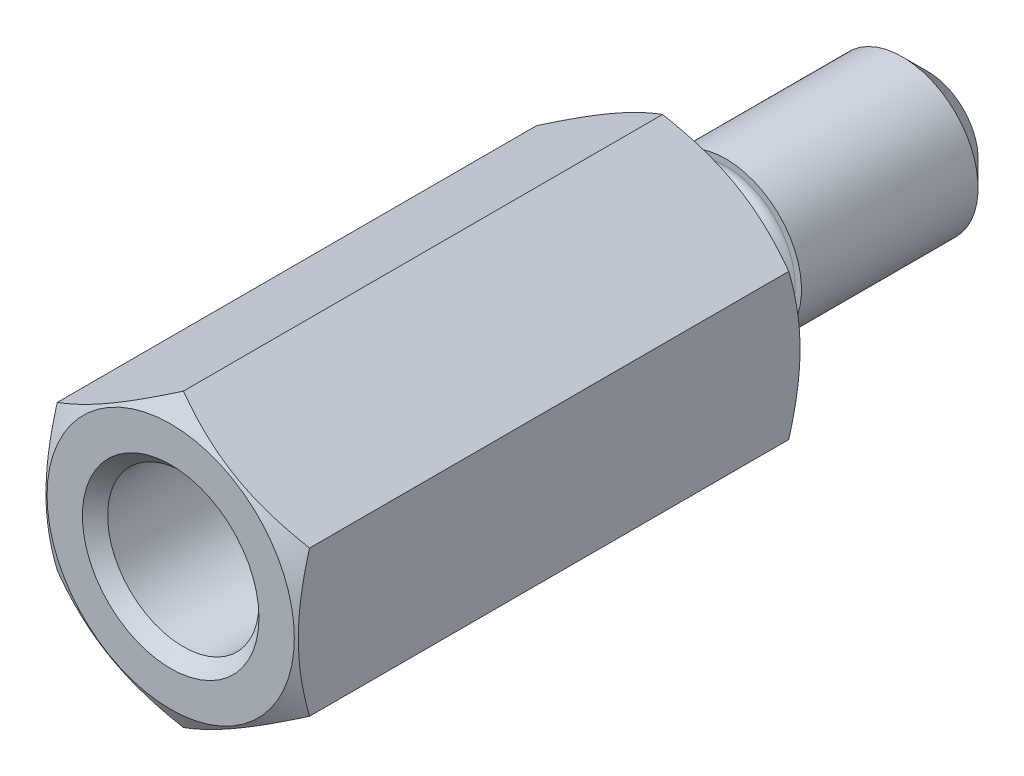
ISO-10303-21;
HEADER;
FILE_DESCRIPTION(('STEP AP214'),'2;1');
FILE_NAME('part.step','',(''),(''),'','','');
FILE_SCHEMA(('AUTOMOTIVE_DESIGN { 1 0 10303 214 1 1 1 1 }'));
ENDSEC;
DATA;
#1=APPLICATION_CONTEXT('core data for automotive mechanical design processes');
#2=APPLICATION_PROTOCOL_DEFINITION('international standard','automotive_design',2000,#1);
#3=PRODUCT_CONTEXT('',#1,'mechanical');
#4=PRODUCT('Part','Part','',(#3));
#5=PRODUCT_RELATED_PRODUCT_CATEGORY('part','',(#4));
#6=PRODUCT_DEFINITION_FORMATION('','',#4);
#7=PRODUCT_DEFINITION_CONTEXT('part definition',#1,'design');
#8=PRODUCT_DEFINITION('design','',#6,#7);
#9=PRODUCT_DEFINITION_SHAPE('','',#8);
#10=(LENGTH_UNIT() NAMED_UNIT(*) SI_UNIT(.MILLI.,.METRE.));
#11=(NAMED_UNIT(*) PLANE_ANGLE_UNIT() SI_UNIT($,.RADIAN.));
#12=(NAMED_UNIT(*) SI_UNIT($,.STERADIAN.) SOLID_ANGLE_UNIT());
#13=UNCERTAINTY_MEASURE_WITH_UNIT(LENGTH_MEASURE(1.E-05),#10,'distance_accuracy_value','');
#14=(GEOMETRIC_REPRESENTATION_CONTEXT(3) GLOBAL_UNCERTAINTY_ASSIGNED_CONTEXT((#13)) GLOBAL_UNIT_ASSIGNED_CONTEXT((#10,
#11,#12)) REPRESENTATION_CONTEXT('',''));
#15=CARTESIAN_POINT('',(0.,0.,0.));
#16=DIRECTION('',(0.,0.,1.));
#17=DIRECTION('',(1.,0.,0.));
#18=AXIS2_PLACEMENT_3D('',#15,#16,#17);
#19=CARTESIAN_POINT('',(0.,-5.77350269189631,0.));
#20=DIRECTION('',(0.,0.,-1.));
#21=DIRECTION('',(-1.,0.,0.));
#22=AXIS2_PLACEMENT_3D('',#19,#20,#21);
#23=PLANE('',#22);
#24=CARTESIAN_POINT('',(0.,0.,0.));
#25=DIRECTION('',(0.,0.,-1.));
#26=DIRECTION('',(-1.,0.,0.));
#27=AXIS2_PLACEMENT_3D('',#24,#25,#26);
#28=CIRCLE('',#27,2.75);
#29=CARTESIAN_POINT('',(-2.75,0.,0.));
#30=VERTEX_POINT('',#29);
#31=EDGE_CURVE('E23',#30,#30,#28,.F.);
#32=ORIENTED_EDGE('',*,*,#31,.T.);
#33=EDGE_LOOP('',(#32));
#34=FACE_BOUND('',#33,.T.);
#35=CARTESIAN_POINT('',(0.,0.,0.));
#36=DIRECTION('',(0.,0.,-1.));
#37=DIRECTION('',(-1.,0.,0.));
#38=AXIS2_PLACEMENT_3D('',#35,#36,#37);
#39=CIRCLE('',#38,4.9);
#40=CARTESIAN_POINT('',(-4.9,0.,0.));
#41=VERTEX_POINT('',#40);
#42=EDGE_CURVE('E73',#41,#41,#39,.T.);
#43=ORIENTED_EDGE('',*,*,#42,.T.);
#44=EDGE_LOOP('',(#43));
#45=FACE_BOUND('',#44,.T.);
#46=ADVANCED_FACE('F14',(#34,#45),#23,.T.);
#47=CARTESIAN_POINT('',(0.,0.,-10.));
#48=DIRECTION('',(0.,0.,1.));
#49=DIRECTION('',(1.,0.,0.));
#50=AXIS2_PLACEMENT_3D('',#47,#48,#49);
#51=CYLINDRICAL_SURFACE('',#50,3.);
#52=CARTESIAN_POINT('',(0.,0.,-2.));
#53=DIRECTION('',(0.,0.,-1.));
#54=DIRECTION('',(-1.,0.,0.));
#55=AXIS2_PLACEMENT_3D('',#52,#53,#54);
#56=CIRCLE('',#55,3.);
#57=CARTESIAN_POINT('',(-3.,0.,-2.));
#58=VERTEX_POINT('',#57);
#59=EDGE_CURVE('E233',#58,#58,#56,.T.);
#60=ORIENTED_EDGE('',*,*,#59,.T.);
#61=EDGE_LOOP('',(#60));
#62=FACE_BOUND('',#61,.T.);
#63=CARTESIAN_POINT('',(0.,0.,-9.));
#64=DIRECTION('',(0.,0.,-1.));
#65=DIRECTION('',(-1.,0.,0.));
#66=AXIS2_PLACEMENT_3D('',#63,#64,#65);
#67=CIRCLE('',#66,3.);
#68=CARTESIAN_POINT('',(-3.,0.,-9.));
#69=VERTEX_POINT('',#68);
#70=EDGE_CURVE('E85',#69,#69,#67,.F.);
#71=ORIENTED_EDGE('',*,*,#70,.T.);
#72=EDGE_LOOP('',(#71));
#73=FACE_BOUND('',#72,.T.);
#74=ADVANCED_FACE('F209',(#62,#73),#51,.T.);
#75=CARTESIAN_POINT('',(0.,0.,-10.));
#76=DIRECTION('',(0.,0.,-1.));
#77=DIRECTION('',(-1.,0.,0.));
#78=AXIS2_PLACEMENT_3D('',#75,#76,#77);
#79=PLANE('',#78);
#80=CARTESIAN_POINT('',(0.,0.,-10.));
#81=DIRECTION('',(0.,0.,-1.));
#82=DIRECTION('',(-1.,0.,0.));
#83=AXIS2_PLACEMENT_3D('',#80,#81,#82);
#84=CIRCLE('',#83,2.);
#85=CARTESIAN_POINT('',(-2.,0.,-10.));
#86=VERTEX_POINT('',#85);
#87=EDGE_CURVE('E82',#86,#86,#84,.T.);
#88=ORIENTED_EDGE('',*,*,#87,.T.);
#89=EDGE_LOOP('',(#88));
#90=FACE_BOUND('',#89,.T.);
#91=ADVANCED_FACE('F213',(#90),#79,.T.);
#92=CARTESIAN_POINT('',(0.,0.,-10.));
#93=DIRECTION('',(0.,0.,1.));
#94=DIRECTION('',(1.,0.,0.));
#95=AXIS2_PLACEMENT_3D('',#92,#93,#94);
#96=CONICAL_SURFACE('',#95,2.,0.785398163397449);
#97=ORIENTED_EDGE('',*,*,#70,.F.);
#98=EDGE_LOOP('',(#97));
#99=FACE_BOUND('',#98,.T.);
#100=ORIENTED_EDGE('',*,*,#87,.F.);
#101=EDGE_LOOP('',(#100));
#102=FACE_BOUND('',#101,.T.);
#103=ADVANCED_FACE('F216',(#99,#102),#96,.T.);
#104=CARTESIAN_POINT('',(0.,0.,-2.));
#105=DIRECTION('',(0.,0.,-1.));
#106=DIRECTION('',(-1.,0.,0.));
#107=AXIS2_PLACEMENT_3D('',#104,#105,#106);
#108=PLANE('',#107);
#109=CARTESIAN_POINT('',(0.,0.,-2.));
#110=DIRECTION('',(0.,0.,-1.));
#111=DIRECTION('',(-1.,0.,0.));
#112=AXIS2_PLACEMENT_3D('',#109,#110,#111);
#113=CIRCLE('',#112,2.75);
#114=CARTESIAN_POINT('',(-2.75,0.,-2.));
#115=VERTEX_POINT('',#114);
#116=EDGE_CURVE('E93',#115,#115,#113,.T.);
#117=ORIENTED_EDGE('',*,*,#116,.T.);
#118=EDGE_LOOP('',(#117));
#119=FACE_BOUND('',#118,.T.);
#120=ORIENTED_EDGE('',*,*,#59,.F.);
#121=EDGE_LOOP('',(#120));
#122=FACE_BOUND('',#121,.T.);
#123=ADVANCED_FACE('F218',(#119,#122),#108,.F.);
#124=CARTESIAN_POINT('',(0.,0.,-2.));
#125=DIRECTION('',(0.,0.,1.));
#126=DIRECTION('',(1.,0.,0.));
#127=AXIS2_PLACEMENT_3D('',#124,#125,#126);
#128=CYLINDRICAL_SURFACE('',#127,2.35);
#129=CARTESIAN_POINT('',(0.,0.,-1.6));
#130=DIRECTION('',(0.,0.,-1.));
#131=DIRECTION('',(-1.,0.,0.));
#132=AXIS2_PLACEMENT_3D('',#129,#130,#131);
#133=CIRCLE('',#132,2.35);
#134=CARTESIAN_POINT('',(-2.35,0.,-1.6));
#135=VERTEX_POINT('',#134);
#136=EDGE_CURVE('E99',#135,#135,#133,.F.);
#137=ORIENTED_EDGE('',*,*,#136,.T.);
#138=EDGE_LOOP('',(#137));
#139=FACE_BOUND('',#138,.T.);
#140=CARTESIAN_POINT('',(0.,0.,-0.4));
#141=DIRECTION('',(0.,0.,-1.));
#142=DIRECTION('',(-1.,0.,0.));
#143=AXIS2_PLACEMENT_3D('',#140,#141,#142);
#144=CIRCLE('',#143,2.35);
#145=CARTESIAN_POINT('',(-2.35,0.,-0.4));
#146=VERTEX_POINT('',#145);
#147=EDGE_CURVE('E96',#146,#146,#144,.T.);
#148=ORIENTED_EDGE('',*,*,#147,.T.);
#149=EDGE_LOOP('',(#148));
#150=FACE_BOUND('',#149,.T.);
#151=ADVANCED_FACE('F121',(#139,#150),#128,.T.);
#152=CARTESIAN_POINT('',(0.,0.,-1.6));
#153=DIRECTION('',(0.,0.,-1.));
#154=DIRECTION('',(-1.,0.,0.));
#155=AXIS2_PLACEMENT_3D('',#152,#153,#154);
#156=TOROIDAL_SURFACE('',#155,2.75,0.4);
#157=ORIENTED_EDGE('',*,*,#136,.F.);
#158=EDGE_LOOP('',(#157));
#159=FACE_BOUND('',#158,.T.);
#160=ORIENTED_EDGE('',*,*,#116,.F.);
#161=EDGE_LOOP('',(#160));
#162=FACE_BOUND('',#161,.T.);
#163=ADVANCED_FACE('F226',(#159,#162),#156,.F.);
#164=CARTESIAN_POINT('',(0.,0.,-0.4));
#165=DIRECTION('',(0.,0.,-1.));
#166=DIRECTION('',(-1.,0.,0.));
#167=AXIS2_PLACEMENT_3D('',#164,#165,#166);
#168=TOROIDAL_SURFACE('',#167,2.75,0.4);
#169=ORIENTED_EDGE('',*,*,#31,.F.);
#170=EDGE_LOOP('',(#169));
#171=FACE_BOUND('',#170,.T.);
#172=ORIENTED_EDGE('',*,*,#147,.F.);
#173=EDGE_LOOP('',(#172));
#174=FACE_BOUND('',#173,.T.);
#175=ADVANCED_FACE('F16',(#171,#174),#168,.F.);
#176=CARTESIAN_POINT('',(0.,0.,0.));
#177=DIRECTION('',(0.,0.,1.));
#178=DIRECTION('',(-1.,0.,0.));
#179=AXIS2_PLACEMENT_3D('',#176,#177,#178);
#180=CONICAL_SURFACE('',#179,4.9,1.0471975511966);
#181=ORIENTED_EDGE('',*,*,#42,.F.);
#182=EDGE_LOOP('',(#181));
#183=FACE_BOUND('',#182,.T.);
#184=CARTESIAN_POINT('',(5.,-28.5513155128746,13.9059532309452));
#185=CARTESIAN_POINT('',(4.99999999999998,-27.6630523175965,13.4008421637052));
#186=CARTESIAN_POINT('',(4.99999999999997,-26.7745196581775,12.8962030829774));
#187=CARTESIAN_POINT('',(4.99999999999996,-24.9956560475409,11.8877916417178));
#188=CARTESIAN_POINT('',(4.99999999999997,-24.1053241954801,11.3840208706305));
#189=CARTESIAN_POINT('',(4.99999999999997,-22.3038221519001,10.3672445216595));
#190=CARTESIAN_POINT('',(4.99999999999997,-21.3926277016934,9.85428190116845));
#191=CARTESIAN_POINT('',(4.99999999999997,-19.5696429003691,8.83179914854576));
#192=CARTESIAN_POINT('',(4.99999999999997,-18.657854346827,8.32227581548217));
#193=CARTESIAN_POINT('',(4.99999999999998,-17.1140952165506,7.46439841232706));
#194=CARTESIAN_POINT('',(4.99999999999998,-16.4827544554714,7.11491185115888));
#195=CARTESIAN_POINT('',(4.99999999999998,-15.2184982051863,6.4188021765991));
#196=CARTESIAN_POINT('',(4.99999999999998,-14.5855827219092,6.07217905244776));
#197=CARTESIAN_POINT('',(4.99999999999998,-13.3150329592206,5.3816200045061));
#198=CARTESIAN_POINT('',(4.99999999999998,-12.6773899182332,5.03770015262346));
#199=CARTESIAN_POINT('',(4.99999999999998,-11.7185820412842,4.52648798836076));
#200=CARTESIAN_POINT('',(4.99999999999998,-11.3986460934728,4.35689168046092));
#201=CARTESIAN_POINT('',(4.99999999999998,-10.7577581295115,4.01963122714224));
#202=CARTESIAN_POINT('',(4.99999999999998,-10.4368061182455,3.85196707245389));
#203=CARTESIAN_POINT('',(4.99999999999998,-9.79912424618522,3.52192099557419));
#204=CARTESIAN_POINT('',(4.99999999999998,-9.48241579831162,3.35949775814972));
#205=CARTESIAN_POINT('',(4.99999999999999,-8.84745364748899,3.03767752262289));
#206=CARTESIAN_POINT('',(4.99999999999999,-8.52919991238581,2.87828058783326));
#207=CARTESIAN_POINT('',(4.99999999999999,-7.89025618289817,2.56321436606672));
#208=CARTESIAN_POINT('',(4.99999999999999,-7.56956325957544,2.40755100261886));
#209=CARTESIAN_POINT('',(4.99999999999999,-6.92566102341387,2.10154520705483));
#210=CARTESIAN_POINT('',(4.99999999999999,-6.60245186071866,1.95120246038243));
#211=CARTESIAN_POINT('',(4.99999999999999,-5.95511193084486,1.65885364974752));
#212=CARTESIAN_POINT('',(4.99999999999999,-5.63100520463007,1.51679464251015));
#213=CARTESIAN_POINT('',(4.99999999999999,-4.97844812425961,1.24262482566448));
#214=CARTESIAN_POINT('',(4.99999999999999,-4.64999647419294,1.11051706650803));
#215=CARTESIAN_POINT('',(4.99999999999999,-3.98854124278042,0.860874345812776));
#216=CARTESIAN_POINT('',(4.99999999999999,-3.65555200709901,0.743301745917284));
#217=CARTESIAN_POINT('',(5.,-2.98310602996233,0.528595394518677));
#218=CARTESIAN_POINT('',(5.00000000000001,-2.6436549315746,0.431444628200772));
#219=CARTESIAN_POINT('',(5.,-2.23946183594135,0.333898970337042));
#220=CARTESIAN_POINT('',(4.99999999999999,-2.17803640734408,0.319561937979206));
#221=CARTESIAN_POINT('',(4.99999999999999,-2.05495871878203,0.291861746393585));
#222=CARTESIAN_POINT('',(4.99999999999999,-1.99330643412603,0.278498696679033));
#223=CARTESIAN_POINT('',(4.99999999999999,-1.80799287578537,0.239944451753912));
#224=CARTESIAN_POINT('',(4.99999999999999,-1.68400579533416,0.216295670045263));
#225=CARTESIAN_POINT('',(4.99999999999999,-1.43531101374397,0.173540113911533));
#226=CARTESIAN_POINT('',(4.99999999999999,-1.31060369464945,0.15443112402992));
#227=CARTESIAN_POINT('',(4.99999999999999,-1.06053603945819,0.1211215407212));
#228=CARTESIAN_POINT('',(5.,-0.93517573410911,0.106920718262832));
#229=CARTESIAN_POINT('',(5.,-0.6867240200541,0.0839938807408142));
#230=CARTESIAN_POINT('',(5.,-0.563643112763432,0.075154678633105));
#231=CARTESIAN_POINT('',(5.,-0.317218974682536,0.0626709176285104));
#232=CARTESIAN_POINT('',(5.,-0.193875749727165,0.0590262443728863));
#233=CARTESIAN_POINT('',(5.,0.0529223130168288,0.0570173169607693));
#234=CARTESIAN_POINT('',(5.,0.176377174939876,0.0586559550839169));
#235=CARTESIAN_POINT('',(5.,0.423107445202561,0.0671792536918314));
#236=CARTESIAN_POINT('',(5.,0.546382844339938,0.074064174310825));
#237=CARTESIAN_POINT('',(5.,0.840374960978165,0.0965927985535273));
#238=CARTESIAN_POINT('',(5.,1.01091463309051,0.114600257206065));
#239=CARTESIAN_POINT('',(5.,1.35077920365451,0.159696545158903));
#240=CARTESIAN_POINT('',(5.,1.52010394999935,0.186786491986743));
#241=CARTESIAN_POINT('',(5.,2.02590980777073,0.280230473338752));
#242=CARTESIAN_POINT('',(5.,2.36017513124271,0.358754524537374));
#243=CARTESIAN_POINT('',(5.,2.86099113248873,0.495780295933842));
#244=CARTESIAN_POINT('',(5.,3.03010177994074,0.54546679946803));
#245=CARTESIAN_POINT('',(5.,3.36667786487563,0.650180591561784));
#246=CARTESIAN_POINT('',(5.,3.53414328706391,0.70520792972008));
#247=CARTESIAN_POINT('',(5.,3.86751086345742,0.819713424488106));
#248=CARTESIAN_POINT('',(5.,4.03341318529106,0.879191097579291));
#249=CARTESIAN_POINT('',(5.,4.36382473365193,1.00186561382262));
#250=CARTESIAN_POINT('',(5.,4.52833402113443,1.06506229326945));
#251=CARTESIAN_POINT('',(5.,4.88531375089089,1.20609806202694));
#252=CARTESIAN_POINT('',(5.,5.0775453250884,1.2845402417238));
#253=CARTESIAN_POINT('',(5.,5.46053865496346,1.44494192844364));
#254=CARTESIAN_POINT('',(5.,5.65130034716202,1.52690158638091));
#255=CARTESIAN_POINT('',(5.,6.22176568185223,1.77709837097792));
#256=CARTESIAN_POINT('',(5.,6.59958569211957,1.94962754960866));
#257=CARTESIAN_POINT('',(5.00000000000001,7.35178984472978,2.30261864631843));
#258=CARTESIAN_POINT('',(5.00000000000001,7.7261713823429,2.48308606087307));
#259=CARTESIAN_POINT('',(5.00000000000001,8.47215735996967,2.84957212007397));
#260=CARTESIAN_POINT('',(5.00000000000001,8.84376205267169,3.03559025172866));
#261=CARTESIAN_POINT('',(5.00000000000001,9.58576462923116,3.412125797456));
#262=CARTESIAN_POINT('',(5.00000000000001,9.95615770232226,3.60265266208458));
#263=CARTESIAN_POINT('',(5.00000000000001,10.6953591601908,3.98676915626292));
#264=CARTESIAN_POINT('',(5.00000000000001,11.0641675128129,4.18035884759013));
#265=CARTESIAN_POINT('',(5.00000000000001,11.8003936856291,4.56980246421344));
#266=CARTESIAN_POINT('',(5.00000000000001,12.1678120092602,4.76565543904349));
#267=CARTESIAN_POINT('',(5.00000000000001,12.9016659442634,5.15919489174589));
#268=CARTESIAN_POINT('',(5.00000000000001,13.2681015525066,5.3568813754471));
#269=CARTESIAN_POINT('',(5.00000000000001,14.2559293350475,5.89232643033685));
#270=CARTESIAN_POINT('',(5.00000000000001,14.8765808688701,6.23145087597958));
#271=CARTESIAN_POINT('',(5.00000000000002,16.1163495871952,6.91265943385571));
#272=CARTESIAN_POINT('',(5.00000000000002,16.7354665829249,7.25474388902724));
#273=CARTESIAN_POINT('',(5.00000000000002,17.9698926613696,7.93957714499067));
#274=CARTESIAN_POINT('',(5.00000000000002,18.5852067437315,8.28231694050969));
#275=CARTESIAN_POINT('',(5.00000000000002,19.8148562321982,8.96936332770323));
#276=CARTESIAN_POINT('',(5.00000000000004,20.4291917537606,9.31366971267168));
#277=CARTESIAN_POINT('',(5.00000000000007,21.0432119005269,9.6585343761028));
#278=B_SPLINE_CURVE_WITH_KNOTS('',3,(#184,#185,#186,#187,#188,#189,#190,#191,#192,#193,#194,
#195,#196,#197,#198,#199,#200,#201,#202,#203,#204,#205,#206,#207,#208,#209,#210,#211,#212,#213,
#214,#215,#216,#217,#218,#219,#220,#221,#222,#223,#224,#225,#226,#227,#228,#229,#230,#231,#232,
#233,#234,#235,#236,#237,#238,#239,#240,#241,#242,#243,#244,#245,#246,#247,#248,#249,#250,#251,
#252,#253,#254,#255,#256,#257,#258,#259,#260,#261,#262,#263,#264,#265,#266,#267,#268,#269,#270,
#271,#272,#273,#274,#275,#276,#277),.UNSPECIFIED.,.F.,.F.,(4,2,2,2,2,2,2,2,2,2,2,2,2,2,2,2,2,2,
2,2,2,2,2,2,2,2,2,2,2,2,2,2,2,2,2,2,2,2,2,2,2,2,2,2,2,2,4),(0.,3.06550911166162,
6.13442960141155,9.27140801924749,12.4048883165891,14.5697357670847,16.7345750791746,
18.9079851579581,19.9943030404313,21.0806157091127,22.1483907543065,23.2161881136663,
24.2855804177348,25.3549093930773,26.4164153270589,27.4782453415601,28.5372654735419,
29.5953997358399,29.7846231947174,29.9738678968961,30.3524526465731,30.7308522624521,
31.1092342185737,31.47932184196,31.8494013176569,32.2196834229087,32.5899838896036,
33.1041595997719,33.6183985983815,34.6470187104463,35.1757476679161,35.7044815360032,
36.2331580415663,36.7618112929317,37.3846276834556,38.0074708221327,39.2533636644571,
40.5001331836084,41.7467878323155,42.9963393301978,44.2459160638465,45.4949858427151,
46.7440595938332,48.8658205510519,50.9878307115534,53.1008206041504,55.213539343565),.UNSPECIFIED.);
#279=CARTESIAN_POINT('',(5.,2.88675134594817,0.504317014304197));
#280=VERTEX_POINT('',#279);
#281=CARTESIAN_POINT('',(5.,-2.88675134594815,0.504317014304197));
#282=VERTEX_POINT('',#281);
#283=EDGE_CURVE('E30',#280,#282,#278,.F.);
#284=ORIENTED_EDGE('',*,*,#283,.T.);
#285=CARTESIAN_POINT('',(5.0002,-2.88663587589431,0.504383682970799));
#286=CARTESIAN_POINT('',(4.78046540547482,-3.0134997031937,0.431121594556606));
#287=CARTESIAN_POINT('',(4.55885141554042,-3.14144859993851,0.364486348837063));
#288=CARTESIAN_POINT('',(4.11178600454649,-3.39956193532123,0.248174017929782));
#289=CARTESIAN_POINT('',(3.88632664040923,-3.5297309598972,0.19853807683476));
#290=CARTESIAN_POINT('',(3.4381676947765,-3.78847564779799,0.121286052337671));
#291=CARTESIAN_POINT('',(3.21553790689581,-3.91701101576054,0.0931554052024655));
#292=CARTESIAN_POINT('',(2.88081009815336,-4.11026620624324,0.067929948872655));
#293=CARTESIAN_POINT('',(2.76915780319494,-4.17472868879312,0.062348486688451));
#294=CARTESIAN_POINT('',(2.54575002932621,-4.3037132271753,0.056937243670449));
#295=CARTESIAN_POINT('',(2.4339945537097,-4.36823528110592,0.0571072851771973));
#296=CARTESIAN_POINT('',(2.12781576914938,-4.54500768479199,0.0654886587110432));
#297=CARTESIAN_POINT('',(1.93349391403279,-4.65719946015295,0.0795647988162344));
#298=CARTESIAN_POINT('',(1.54613989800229,-4.88083840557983,0.124200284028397));
#299=CARTESIAN_POINT('',(1.35310909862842,-4.99228478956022,0.154774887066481));
#300=CARTESIAN_POINT('',(0.964974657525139,-5.21637431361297,0.231203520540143));
#301=CARTESIAN_POINT('',(0.769920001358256,-5.32898917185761,0.277381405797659));
#302=CARTESIAN_POINT('',(0.382719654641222,-5.55253939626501,0.38218682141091));
#303=CARTESIAN_POINT('',(0.190569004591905,-5.66347762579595,0.440789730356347));
#304=CARTESIAN_POINT('',(-0.000199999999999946,-5.77361816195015,0.504383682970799));
#305=B_SPLINE_CURVE_WITH_KNOTS('',3,(#285,#286,#287,#288,#289,#290,#291,#292,#293,#294,#295,
#296,#297,#298,#299,#300,#301,#302,#303,#304),.UNSPECIFIED.,.F.,.F.,(4,2,2,2,2,2,2,2,2,4),(0.,
0.79255584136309,1.58701660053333,2.3618153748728,2.74884076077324,3.13585419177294,
3.80962362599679,4.4840172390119,5.17336882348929,5.86136694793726),.UNSPECIFIED.);
#306=CARTESIAN_POINT('',(0.,-5.77350269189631,0.504317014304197));
#307=VERTEX_POINT('',#306);
#308=EDGE_CURVE('E67',#282,#307,#305,.T.);
#309=ORIENTED_EDGE('',*,*,#308,.T.);
#310=CARTESIAN_POINT('',(0.000200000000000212,-5.77361816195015,0.504383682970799));
#311=CARTESIAN_POINT('',(-0.219534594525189,-5.64675433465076,0.43112159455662));
#312=CARTESIAN_POINT('',(-0.441148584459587,-5.51880543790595,0.364486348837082));
#313=CARTESIAN_POINT('',(-0.888213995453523,-5.26069210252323,0.248174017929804));
#314=CARTESIAN_POINT('',(-1.11367335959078,-5.13052307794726,0.19853807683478));
#315=CARTESIAN_POINT('',(-1.56183230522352,-4.87177839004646,0.121286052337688));
#316=CARTESIAN_POINT('',(-1.78446209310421,-4.74324302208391,0.0931554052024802));
#317=CARTESIAN_POINT('',(-2.11918990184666,-4.5499878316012,0.067929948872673));
#318=CARTESIAN_POINT('',(-2.23084219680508,-4.48552534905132,0.062348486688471));
#319=CARTESIAN_POINT('',(-2.45424997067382,-4.35654081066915,0.0569372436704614));
#320=CARTESIAN_POINT('',(-2.56600544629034,-4.29201875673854,0.0571072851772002));
#321=CARTESIAN_POINT('',(-2.87218423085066,-4.11524635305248,0.0654886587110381));
#322=CARTESIAN_POINT('',(-3.06650608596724,-4.0030545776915,0.0795647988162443));
#323=CARTESIAN_POINT('',(-3.45386010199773,-3.77941563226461,0.124200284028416));
#324=CARTESIAN_POINT('',(-3.64689090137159,-3.66796924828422,0.154774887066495));
#325=CARTESIAN_POINT('',(-4.03502534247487,-3.44387972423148,0.231203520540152));
#326=CARTESIAN_POINT('',(-4.23007999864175,-3.33126486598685,0.277381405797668));
#327=CARTESIAN_POINT('',(-4.61728034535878,-3.10771464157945,0.382186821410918));
#328=CARTESIAN_POINT('',(-4.80943099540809,-2.99677641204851,0.440789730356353));
#329=CARTESIAN_POINT('',(-5.0002,-2.88663587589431,0.504383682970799));
#330=B_SPLINE_CURVE_WITH_KNOTS('',3,(#310,#311,#312,#313,#314,#315,#316,#317,#318,#319,#320,
#321,#322,#323,#324,#325,#326,#327,#328,#329),.UNSPECIFIED.,.F.,.F.,(4,2,2,2,2,2,2,2,2,4),(0.,
0.792555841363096,1.58701660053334,2.36181537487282,2.74884076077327,3.13585419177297,
3.80962362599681,4.48401723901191,5.1733688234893,5.86136694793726),.UNSPECIFIED.);
#331=CARTESIAN_POINT('',(-5.,-2.88675134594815,0.504317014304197));
#332=VERTEX_POINT('',#331);
#333=EDGE_CURVE('E69',#307,#332,#330,.T.);
#334=ORIENTED_EDGE('',*,*,#333,.T.);
#335=CARTESIAN_POINT('',(-5.,-28.5513155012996,13.9059532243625));
#336=CARTESIAN_POINT('',(-5.,-27.6630523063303,13.4008421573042));
#337=CARTESIAN_POINT('',(-5.,-26.7745196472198,12.8962030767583));
#338=CARTESIAN_POINT('',(-5.,-24.9956560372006,11.8877916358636));
#339=CARTESIAN_POINT('',(-5.,-24.1053241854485,11.3840208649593));
#340=CARTESIAN_POINT('',(-5.,-22.303822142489,10.3672445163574));
#341=CARTESIAN_POINT('',(-5.,-21.3926276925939,9.85428189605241));
#342=CARTESIAN_POINT('',(-5.,-19.5696428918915,8.8317991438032));
#343=CARTESIAN_POINT('',(-5.,-18.6578543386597,8.32227581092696));
#344=CARTESIAN_POINT('',(-5.,-17.1140952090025,7.46439840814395));
#345=CARTESIAN_POINT('',(-5.,-16.4827544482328,7.11491184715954));
#346=CARTESIAN_POINT('',(-5.,-15.2184981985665,6.41880217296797));
#347=CARTESIAN_POINT('',(-5.,-14.5855827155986,6.07217904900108));
#348=CARTESIAN_POINT('',(-5.,-13.3150329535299,5.38162000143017));
#349=CARTESIAN_POINT('',(-5.,-12.6773899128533,5.03770014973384));
#350=CARTESIAN_POINT('',(-5.,-11.71858203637,4.52648798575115));
#351=CARTESIAN_POINT('',(-5.,-11.3986460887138,4.3568916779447));
#352=CARTESIAN_POINT('',(-5.,-10.7577581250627,4.019631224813));
#353=CARTESIAN_POINT('',(-5.,-10.4368061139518,3.85196707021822));
#354=CARTESIAN_POINT('',(-5.,-9.79912424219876,3.52192099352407));
#355=CARTESIAN_POINT('',(-5.,-9.48241579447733,3.35949775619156));
#356=CARTESIAN_POINT('',(-5.,-8.84745364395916,3.0376775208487));
#357=CARTESIAN_POINT('',(-5.,-8.52919990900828,2.87828058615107));
#358=CARTESIAN_POINT('',(-5.,-7.89025617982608,2.56321436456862));
#359=CARTESIAN_POINT('',(-5.,-7.56956325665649,2.40755100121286));
#360=CARTESIAN_POINT('',(-5.,-6.9256610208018,2.10154520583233));
#361=CARTESIAN_POINT('',(-5.,-6.60245185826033,1.95120245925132));
#362=CARTESIAN_POINT('',(-5.,-5.95511192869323,1.65885364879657));
#363=CARTESIAN_POINT('',(-5.,-5.63100520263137,1.516794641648));
#364=CARTESIAN_POINT('',(-5.,-4.97844812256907,1.24262482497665));
#365=CARTESIAN_POINT('',(-5.,-4.64999647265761,1.11051706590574));
#366=CARTESIAN_POINT('',(-5.,-3.98854124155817,0.860874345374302));
#367=CARTESIAN_POINT('',(-5.,-3.65555200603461,0.743301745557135));
#368=CARTESIAN_POINT('',(-5.,-2.98310602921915,0.528595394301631));
#369=CARTESIAN_POINT('',(-5.,-2.64365493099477,0.431444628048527));
#370=CARTESIAN_POINT('',(-5.,-2.23946183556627,0.333898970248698));
#371=CARTESIAN_POINT('',(-5.,-2.17803640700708,0.319561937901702));
#372=CARTESIAN_POINT('',(-5.,-2.05495871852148,0.291861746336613));
#373=CARTESIAN_POINT('',(-5.,-1.99330643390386,0.278498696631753));
#374=CARTESIAN_POINT('',(-5.,-1.80799287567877,0.239944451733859));
#375=CARTESIAN_POINT('',(-5.,-1.68400579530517,0.216295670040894));
#376=CARTESIAN_POINT('',(-5.,-1.43531101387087,0.173540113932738));
#377=CARTESIAN_POINT('',(-5.,-1.31060369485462,0.154431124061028));
#378=CARTESIAN_POINT('',(-5.,-1.06053603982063,0.121121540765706));
#379=CARTESIAN_POINT('',(-5.,-0.935175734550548,0.106920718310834));
#380=CARTESIAN_POINT('',(-5.,-0.686724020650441,0.083993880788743));
#381=CARTESIAN_POINT('',(-5.,-0.563643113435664,0.0751546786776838));
#382=CARTESIAN_POINT('',(-5.,-0.31721897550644,0.0626709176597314));
#383=CARTESIAN_POINT('',(-5.,-0.193875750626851,0.0590262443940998));
#384=CARTESIAN_POINT('',(-5.,0.0529223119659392,0.0570173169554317));
#385=CARTESIAN_POINT('',(-5.,0.176377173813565,0.058655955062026));
#386=CARTESIAN_POINT('',(-5.,0.423107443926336,0.06717925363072));
#387=CARTESIAN_POINT('',(-5.,0.546382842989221,0.0740641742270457));
#388=CARTESIAN_POINT('',(-5.,0.840374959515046,0.0965927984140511));
#389=CARTESIAN_POINT('',(-5.,1.01091463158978,0.114600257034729));
#390=CARTESIAN_POINT('',(-5.,1.35077920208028,0.159696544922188));
#391=CARTESIAN_POINT('',(-5.,1.52010394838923,0.186786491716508));
#392=CARTESIAN_POINT('',(-5.,2.02590980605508,0.280230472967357));
#393=CARTESIAN_POINT('',(-5.,2.36017512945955,0.358754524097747));
#394=CARTESIAN_POINT('',(-5.,2.86099113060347,0.495780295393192));
#395=CARTESIAN_POINT('',(-5.,3.03010177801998,0.545466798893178));
#396=CARTESIAN_POINT('',(-5.,3.3666778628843,0.650180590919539));
#397=CARTESIAN_POINT('',(-5.,3.53414328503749,0.705207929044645));
#398=CARTESIAN_POINT('',(-5.,3.86751086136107,0.819713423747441));
#399=CARTESIAN_POINT('',(-5.,4.03341318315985,0.879191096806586));
#400=CARTESIAN_POINT('',(-5.,4.36382473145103,1.00186561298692));
#401=CARTESIAN_POINT('',(-5.,4.5283340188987,1.06506229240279));
#402=CARTESIAN_POINT('',(-5.,4.88531374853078,1.20609806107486));
#403=CARTESIAN_POINT('',(-5.,5.07754532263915,1.28454024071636));
#404=CARTESIAN_POINT('',(-5.,5.46053865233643,1.44494192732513));
#405=CARTESIAN_POINT('',(-5.,5.65130034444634,1.5269015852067));
#406=CARTESIAN_POINT('',(-5.,6.22176567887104,1.77709836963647));
#407=CARTESIAN_POINT('',(-5.,6.59958568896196,1.94962754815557));
#408=CARTESIAN_POINT('',(-5.,7.35178984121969,2.30261864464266));
#409=CARTESIAN_POINT('',(-5.,7.72617137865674,2.48308605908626));
#410=CARTESIAN_POINT('',(-5.,8.47215735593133,2.84957211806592));
#411=CARTESIAN_POINT('',(-5.,8.84376204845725,3.03559024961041));
#412=CARTESIAN_POINT('',(-5.,9.58576462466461,3.41212579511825));
#413=CARTESIAN_POINT('',(-5.,9.9561576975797,3.60265265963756));
#414=CARTESIAN_POINT('',(-5.,10.6953591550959,3.9867691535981));
#415=CARTESIAN_POINT('',(-5.,11.0641675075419,4.18035884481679));
#416=CARTESIAN_POINT('',(-5.,11.8003936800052,4.56980246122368));
#417=CARTESIAN_POINT('',(-5.,12.1678120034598,4.76565543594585));
#418=CARTESIAN_POINT('',(-5.,12.9016659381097,5.15919488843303));
#419=CARTESIAN_POINT('',(-5.,13.2681015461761,5.3568813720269));
#420=CARTESIAN_POINT('',(-5.,14.2559293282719,5.89232642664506));
#421=CARTESIAN_POINT('',(-5.,14.8765808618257,6.23145087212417));
#422=CARTESIAN_POINT('',(-5.,16.1163495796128,6.91265942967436));
#423=CARTESIAN_POINT('',(-5.,16.7354665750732,7.25474388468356));
#424=CARTESIAN_POINT('',(-5.,17.9698926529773,7.9395771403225));
#425=CARTESIAN_POINT('',(-5.,18.5852067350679,8.28231693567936));
#426=CARTESIAN_POINT('',(-5.,19.8148562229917,8.96936332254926));
#427=CARTESIAN_POINT('',(-5.,20.4291917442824,9.31366970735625));
#428=CARTESIAN_POINT('',(-5.,21.043211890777,9.65853437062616));
#429=B_SPLINE_CURVE_WITH_KNOTS('',3,(#335,#336,#337,#338,#339,#340,#341,#342,#343,#344,#345,
#346,#347,#348,#349,#350,#351,#352,#353,#354,#355,#356,#357,#358,#359,#360,#361,#362,#363,#364,
#365,#366,#367,#368,#369,#370,#371,#372,#373,#374,#375,#376,#377,#378,#379,#380,#381,#382,#383,
#384,#385,#386,#387,#388,#389,#390,#391,#392,#393,#394,#395,#396,#397,#398,#399,#400,#401,#402,
#403,#404,#405,#406,#407,#408,#409,#410,#411,#412,#413,#414,#415,#416,#417,#418,#419,#420,#421,
#422,#423,#424,#425,#426,#427,#428),.UNSPECIFIED.,.F.,.F.,(4,2,2,2,2,2,2,2,2,2,2,2,2,2,2,2,2,2,
2,2,2,2,2,2,2,2,2,2,2,2,2,2,2,2,2,2,2,2,2,2,2,2,2,2,2,2,4),(0.,3.06550911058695,
6.13442959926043,9.2714080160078,12.4048883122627,14.5697357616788,16.7345750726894,
18.907985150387,19.9943030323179,21.0806157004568,22.1483907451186,23.2161881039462,
24.2855804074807,25.3549093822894,26.4164153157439,27.4782453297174,28.5372654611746,
29.5953997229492,29.784623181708,29.9738678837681,30.3524526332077,30.7308522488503,
31.1092342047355,31.4793218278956,31.8494013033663,32.2196834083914,32.5899838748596,
33.1041595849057,33.6183985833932,34.6470186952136,35.1757476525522,35.7044815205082,
36.2331580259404,36.761811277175,37.3846276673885,38.0074708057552,39.253363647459,
40.5001331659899,41.7467878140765,42.9963393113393,44.2459160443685,45.4949858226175,
46.744059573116,48.8658205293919,50.9878306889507,53.1008205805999,55.2135393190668),.UNSPECIFIED.);
#430=CARTESIAN_POINT('',(-5.,2.88675134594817,0.504317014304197));
#431=VERTEX_POINT('',#430);
#432=EDGE_CURVE('E78',#332,#431,#429,.T.);
#433=ORIENTED_EDGE('',*,*,#432,.T.);
#434=CARTESIAN_POINT('',(-5.0002,2.88663587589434,0.504383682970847));
#435=CARTESIAN_POINT('',(-4.78046540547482,3.01349970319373,0.431121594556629));
#436=CARTESIAN_POINT('',(-4.55885141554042,3.14144859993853,0.364486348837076));
#437=CARTESIAN_POINT('',(-4.11178600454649,3.39956193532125,0.248174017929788));
#438=CARTESIAN_POINT('',(-3.88632664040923,3.52973095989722,0.198538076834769));
#439=CARTESIAN_POINT('',(-3.43816769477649,3.78847564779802,0.121286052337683));
#440=CARTESIAN_POINT('',(-3.21553790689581,3.91701101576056,0.093155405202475));
#441=CARTESIAN_POINT('',(-2.88081009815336,4.11026620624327,0.0679299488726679));
#442=CARTESIAN_POINT('',(-2.76915780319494,4.17472868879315,0.0623484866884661));
#443=CARTESIAN_POINT('',(-2.54575002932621,4.30371322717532,0.0569372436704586));
#444=CARTESIAN_POINT('',(-2.4339945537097,4.36823528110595,0.0571072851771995));
#445=CARTESIAN_POINT('',(-2.12781576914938,4.54500768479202,0.0654886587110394));
#446=CARTESIAN_POINT('',(-1.93349391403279,4.65719946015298,0.0795647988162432));
#447=CARTESIAN_POINT('',(-1.54613989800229,4.88083840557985,0.124200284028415));
#448=CARTESIAN_POINT('',(-1.35310909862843,4.99228478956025,0.154774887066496));
#449=CARTESIAN_POINT('',(-0.964974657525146,5.216374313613,0.231203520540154));
#450=CARTESIAN_POINT('',(-0.769920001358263,5.32898917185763,0.277381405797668));
#451=CARTESIAN_POINT('',(-0.382719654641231,5.55253939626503,0.382186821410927));
#452=CARTESIAN_POINT('',(-0.190569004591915,5.66347762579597,0.440789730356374));
#453=CARTESIAN_POINT('',(0.000199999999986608,5.77361816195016,0.504383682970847));
#454=B_SPLINE_CURVE_WITH_KNOTS('',3,(#434,#435,#436,#437,#438,#439,#440,#441,#442,#443,#444,
#445,#446,#447,#448,#449,#450,#451,#452,#453),.UNSPECIFIED.,.F.,.F.,(4,2,2,2,2,2,2,2,2,4),(0.,
0.792555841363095,1.58701660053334,2.36181537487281,2.74884076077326,3.13585419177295,
3.8096236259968,4.4840172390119,5.17336882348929,5.86136694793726),.UNSPECIFIED.);
#455=CARTESIAN_POINT('',(0.,5.77350269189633,0.504317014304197));
#456=VERTEX_POINT('',#455);
#457=EDGE_CURVE('E175',#431,#456,#454,.T.);
#458=ORIENTED_EDGE('',*,*,#457,.T.);
#459=CARTESIAN_POINT('',(-0.000200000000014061,5.77361816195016,0.504383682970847));
#460=CARTESIAN_POINT('',(0.219534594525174,5.64675433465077,0.431121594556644));
#461=CARTESIAN_POINT('',(0.441148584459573,5.51880543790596,0.364486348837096));
#462=CARTESIAN_POINT('',(0.888213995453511,5.26069210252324,0.24817401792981));
#463=CARTESIAN_POINT('',(1.11367335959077,5.13052307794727,0.198538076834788));
#464=CARTESIAN_POINT('',(1.56183230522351,4.87177839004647,0.121286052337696));
#465=CARTESIAN_POINT('',(1.7844620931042,4.74324302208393,0.093155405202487));
#466=CARTESIAN_POINT('',(2.11918990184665,4.54998783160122,0.0679299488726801));
#467=CARTESIAN_POINT('',(2.23084219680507,4.48552534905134,0.0623484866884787));
#468=CARTESIAN_POINT('',(2.45424997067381,4.35654081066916,0.0569372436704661));
#469=CARTESIAN_POINT('',(2.56600544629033,4.29201875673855,0.0571072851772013));
#470=CARTESIAN_POINT('',(2.87218423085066,4.11524635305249,0.0654886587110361));
#471=CARTESIAN_POINT('',(3.06650608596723,4.00305457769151,0.0795647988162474));
#472=CARTESIAN_POINT('',(3.45386010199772,3.77941563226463,0.124200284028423));
#473=CARTESIAN_POINT('',(3.64689090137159,3.66796924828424,0.1547748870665));
#474=CARTESIAN_POINT('',(4.03502534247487,3.4438797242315,0.231203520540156));
#475=CARTESIAN_POINT('',(4.23007999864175,3.33126486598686,0.277381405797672));
#476=CARTESIAN_POINT('',(4.61728034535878,3.10771464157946,0.382186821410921));
#477=CARTESIAN_POINT('',(4.80943099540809,2.99677641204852,0.440789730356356));
#478=CARTESIAN_POINT('',(5.0002,2.88663587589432,0.504383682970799));
#479=B_SPLINE_CURVE_WITH_KNOTS('',3,(#459,#460,#461,#462,#463,#464,#465,#466,#467,#468,#469,
#470,#471,#472,#473,#474,#475,#476,#477,#478),.UNSPECIFIED.,.F.,.F.,(4,2,2,2,2,2,2,2,2,4),(0.,
0.792555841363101,1.58701660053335,2.36181537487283,2.74884076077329,3.13585419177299,
3.80962362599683,4.48401723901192,5.17336882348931,5.86136694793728),.UNSPECIFIED.);
#480=EDGE_CURVE('E182',#456,#280,#479,.T.);
#481=ORIENTED_EDGE('',*,*,#480,.T.);
#482=EDGE_LOOP('',(#284,#309,#334,#433,#458,#481));
#483=FACE_BOUND('',#482,.T.);
#484=ADVANCED_FACE('F68',(#183,#483),#180,.T.);
#485=CARTESIAN_POINT('',(0.,-5.77350269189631,20.));
#486=DIRECTION('',(0.,0.,-1.));
#487=DIRECTION('',(-1.,0.,0.));
#488=AXIS2_PLACEMENT_3D('',#485,#486,#487);
#489=PLANE('',#488);
#490=CARTESIAN_POINT('',(0.,0.,20.));
#491=DIRECTION('',(0.,0.,1.));
#492=DIRECTION('',(1.,0.,0.));
#493=AXIS2_PLACEMENT_3D('',#490,#491,#492);
#494=CIRCLE('',#493,3.5);
#495=CARTESIAN_POINT('',(3.5,0.,20.));
#496=VERTEX_POINT('',#495);
#497=EDGE_CURVE('E406',#496,#496,#494,.T.);
#498=ORIENTED_EDGE('',*,*,#497,.F.);
#499=EDGE_LOOP('',(#498));
#500=FACE_BOUND('',#499,.T.);
#501=CARTESIAN_POINT('',(0.,0.,20.));
#502=DIRECTION('',(0.,0.,1.));
#503=DIRECTION('',(1.,0.,0.));
#504=AXIS2_PLACEMENT_3D('',#501,#502,#503);
#505=CIRCLE('',#504,4.9);
#506=CARTESIAN_POINT('',(4.9,0.,20.));
#507=VERTEX_POINT('',#506);
#508=EDGE_CURVE('E196',#507,#507,#505,.T.);
#509=ORIENTED_EDGE('',*,*,#508,.T.);
#510=EDGE_LOOP('',(#509));
#511=FACE_BOUND('',#510,.T.);
#512=ADVANCED_FACE('F117',(#500,#511),#489,.F.);
#513=CARTESIAN_POINT('',(0.,0.,20.));
#514=DIRECTION('',(0.,0.,-1.));
#515=DIRECTION('',(1.,0.,0.));
#516=AXIS2_PLACEMENT_3D('',#513,#514,#515);
#517=CONICAL_SURFACE('',#516,4.9,1.0471975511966);
#518=ORIENTED_EDGE('',*,*,#508,.F.);
#519=EDGE_LOOP('',(#518));
#520=FACE_BOUND('',#519,.T.);
#521=CARTESIAN_POINT('',(5.,-28.7414089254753,5.9859308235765));
#522=CARTESIAN_POINT('',(4.99999999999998,-27.8507954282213,6.49247880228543));
#523=CARTESIAN_POINT('',(4.99999999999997,-26.959915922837,6.99856089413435));
#524=CARTESIAN_POINT('',(4.99999999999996,-25.1764038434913,8.00986143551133));
#525=CARTESIAN_POINT('',(4.99999999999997,-24.2837704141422,8.51507837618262));
#526=CARTESIAN_POINT('',(4.99999999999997,-22.4784623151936,9.53434206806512));
#527=CARTESIAN_POINT('',(4.99999999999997,-21.5657647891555,10.0483483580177));
#528=CARTESIAN_POINT('',(4.99999999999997,-19.7397700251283,11.0729960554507));
#529=CARTESIAN_POINT('',(4.99999999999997,-18.8264744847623,11.58364048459));
#530=CARTESIAN_POINT('',(4.99999999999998,-17.2770429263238,12.445259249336));
#531=CARTESIAN_POINT('',(4.99999999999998,-16.6415171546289,12.7973301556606));
#532=CARTESIAN_POINT('',(4.99999999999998,-15.3689109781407,13.4986475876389));
#533=CARTESIAN_POINT('',(4.99999999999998,-14.7318305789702,13.8478941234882));
#534=CARTESIAN_POINT('',(4.99999999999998,-13.4530517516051,14.543720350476));
#535=CARTESIAN_POINT('',(4.99999999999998,-12.8113449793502,14.8902847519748));
#536=CARTESIAN_POINT('',(4.99999999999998,-11.8464734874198,15.4055359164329));
#537=CARTESIAN_POINT('',(4.99999999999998,-11.5245205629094,15.5764910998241));
#538=CARTESIAN_POINT('',(4.99999999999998,-10.8796129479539,15.91650008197));
#539=CARTESIAN_POINT('',(4.99999999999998,-10.5566582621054,16.0855538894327));
#540=CARTESIAN_POINT('',(4.99999999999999,-9.91481440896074,16.4185035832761));
#541=CARTESIAN_POINT('',(4.99999999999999,-9.59594555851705,16.5824385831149));
#542=CARTESIAN_POINT('',(4.99999999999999,-8.95668241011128,16.907329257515));
#543=CARTESIAN_POINT('',(4.99999999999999,-8.63628808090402,17.0682848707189));
#544=CARTESIAN_POINT('',(4.99999999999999,-7.9930979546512,17.3865268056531));
#545=CARTESIAN_POINT('',(4.99999999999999,-7.67029934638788,17.5438074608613));
#546=CARTESIAN_POINT('',(4.99999999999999,-7.02221606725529,17.8531334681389));
#547=CARTESIAN_POINT('',(4.99999999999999,-6.69693154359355,18.0051791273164));
#548=CARTESIAN_POINT('',(4.99999999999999,-6.04541241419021,18.3010742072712));
#549=CARTESIAN_POINT('',(4.99999999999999,-5.71920080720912,18.4449739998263));
#550=CARTESIAN_POINT('',(4.99999999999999,-5.06246930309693,18.7229779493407));
#551=CARTESIAN_POINT('',(4.99999999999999,-4.73194814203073,18.8570791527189));
#552=CARTESIAN_POINT('',(4.99999999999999,-4.06635572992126,19.1109133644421));
#553=CARTESIAN_POINT('',(4.99999999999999,-3.73129835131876,19.2306824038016));
#554=CARTESIAN_POINT('',(5.,-3.0546905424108,19.4500144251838));
#555=CARTESIAN_POINT('',(5.00000000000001,-2.71314563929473,19.5495938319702));
#556=CARTESIAN_POINT('',(5.,-2.30655825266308,19.650068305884));
#557=CARTESIAN_POINT('',(4.99999999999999,-2.24489475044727,19.6648233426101));
#558=CARTESIAN_POINT('',(4.99999999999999,-2.12133736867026,19.6933684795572));
#559=CARTESIAN_POINT('',(4.99999999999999,-2.05944346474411,19.7071584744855));
#560=CARTESIAN_POINT('',(4.99999999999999,-1.8733997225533,19.7470059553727));
#561=CARTESIAN_POINT('',(4.99999999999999,-1.74891735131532,19.7715335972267));
#562=CARTESIAN_POINT('',(4.99999999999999,-1.49920775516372,19.8160702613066));
#563=CARTESIAN_POINT('',(4.99999999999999,-1.37398092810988,19.8360815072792));
#564=CARTESIAN_POINT('',(4.99999999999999,-1.1228423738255,19.8712053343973));
#565=CARTESIAN_POINT('',(5.,-0.996930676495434,19.8863181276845));
#566=CARTESIAN_POINT('',(5.,-0.747392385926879,19.9110360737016));
#567=CARTESIAN_POINT('',(5.,-0.623777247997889,19.9207562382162));
#568=CARTESIAN_POINT('',(5.,-0.376247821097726,19.9349765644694));
#569=CARTESIAN_POINT('',(5.,-0.252333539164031,19.9394768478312));
#570=CARTESIAN_POINT('',(5.,-0.00435862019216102,19.9431513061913));
#571=CARTESIAN_POINT('',(5.,0.119702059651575,19.942322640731));
#572=CARTESIAN_POINT('',(5.,0.367675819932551,19.9353542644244));
#573=CARTESIAN_POINT('',(5.,0.491588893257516,19.929214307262));
#574=CARTESIAN_POINT('',(5.,0.784641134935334,19.9085453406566));
#575=CARTESIAN_POINT('',(5.,0.953624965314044,19.8917591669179));
#576=CARTESIAN_POINT('',(5.,1.29044447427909,19.8491838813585));
#577=CARTESIAN_POINT('',(5.,1.45828001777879,19.8233937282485));
#578=CARTESIAN_POINT('',(5.,1.95969522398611,19.7338925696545));
#579=CARTESIAN_POINT('',(5.,2.29114473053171,19.658053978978));
#580=CARTESIAN_POINT('',(5.,2.78776955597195,19.5250135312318));
#581=CARTESIAN_POINT('',(5.,2.95546494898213,19.4766677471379));
#582=CARTESIAN_POINT('',(5.,3.28922761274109,19.3745990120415));
#583=CARTESIAN_POINT('',(5.,3.45529486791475,19.3208760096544));
#584=CARTESIAN_POINT('',(5.,3.7858778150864,19.2089361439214));
#585=CARTESIAN_POINT('',(5.,3.95039363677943,19.1507196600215));
#586=CARTESIAN_POINT('',(5.,4.27803337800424,19.0305264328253));
#587=CARTESIAN_POINT('',(5.,4.44115735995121,18.9685498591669));
#588=CARTESIAN_POINT('',(5.,4.79343815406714,18.8307859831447));
#589=CARTESIAN_POINT('',(5.,4.98237052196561,18.7544262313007));
#590=CARTESIAN_POINT('',(5.,5.35878215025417,18.5981977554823));
#591=CARTESIAN_POINT('',(5.,5.54626134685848,18.5183288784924));
#592=CARTESIAN_POINT('',(5.,6.10689419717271,18.2744036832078));
#593=CARTESIAN_POINT('',(5.,6.47817891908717,18.106054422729));
#594=CARTESIAN_POINT('',(5.00000000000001,7.21732354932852,17.7613911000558));
#595=CARTESIAN_POINT('',(5.00000000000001,7.58518078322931,17.585071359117));
#596=CARTESIAN_POINT('',(5.00000000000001,8.31811401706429,17.2268439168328));
#597=CARTESIAN_POINT('',(5.00000000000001,8.68319027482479,17.0449367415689));
#598=CARTESIAN_POINT('',(5.00000000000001,9.41213968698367,16.6765837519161));
#599=CARTESIAN_POINT('',(5.00000000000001,9.7760078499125,16.4901280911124));
#600=CARTESIAN_POINT('',(5.00000000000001,10.5021488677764,16.1141229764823));
#601=CARTESIAN_POINT('',(5.00000000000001,10.8644216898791,15.9245734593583));
#602=CARTESIAN_POINT('',(5.00000000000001,11.5875649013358,15.5431843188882));
#603=CARTESIAN_POINT('',(5.00000000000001,11.9484358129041,15.3513456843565));
#604=CARTESIAN_POINT('',(5.00000000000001,12.66918549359,14.9658125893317));
#605=CARTESIAN_POINT('',(5.00000000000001,13.0290642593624,14.7721181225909));
#606=CARTESIAN_POINT('',(5.00000000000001,13.9998320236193,14.2470715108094));
#607=CARTESIAN_POINT('',(5.00000000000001,14.6099700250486,13.9143313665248));
#608=CARTESIAN_POINT('',(5.00000000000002,15.8286899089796,13.245845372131));
#609=CARTESIAN_POINT('',(5.00000000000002,16.4372715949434,12.9100991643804));
#610=CARTESIAN_POINT('',(5.00000000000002,17.6505537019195,12.237937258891));
#611=CARTESIAN_POINT('',(5.00000000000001,18.2552593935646,11.9015310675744));
#612=CARTESIAN_POINT('',(5.00000000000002,19.4636778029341,11.2271265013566));
#613=CARTESIAN_POINT('',(5.00000000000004,20.0673906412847,10.889128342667));
#614=CARTESIAN_POINT('',(5.00000000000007,20.6707831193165,10.5505626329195));
#615=B_SPLINE_CURVE_WITH_KNOTS('',3,(#521,#522,#523,#524,#525,#526,#527,#528,#529,#530,#531,
#532,#533,#534,#535,#536,#537,#538,#539,#540,#541,#542,#543,#544,#545,#546,#547,#548,#549,#550,
#551,#552,#553,#554,#555,#556,#557,#558,#559,#560,#561,#562,#563,#564,#565,#566,#567,#568,#569,
#570,#571,#572,#573,#574,#575,#576,#577,#578,#579,#580,#581,#582,#583,#584,#585,#586,#587,#588,
#589,#590,#591,#592,#593,#594,#595,#596,#597,#598,#599,#600,#601,#602,#603,#604,#605,#606,#607,
#608,#609,#610,#611,#612,#613,#614),.UNSPECIFIED.,.F.,.F.,(4,2,2,2,2,2,2,2,2,2,2,2,2,2,2,2,2,2,
2,2,2,2,2,2,2,2,2,2,2,2,2,2,2,2,2,2,2,2,2,2,2,2,2,2,2,2,4),(0.,3.0737691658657,6.15083570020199,
9.29327960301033,12.4323475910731,14.6119345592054,16.7915136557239,18.9794211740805,
20.0729950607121,21.166563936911,22.2421766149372,23.3178114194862,24.3950078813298,
25.4721410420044,26.541654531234,27.6114890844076,28.6785749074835,29.7447891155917,
29.9349961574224,30.1252239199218,30.5057705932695,30.8861294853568,31.2664719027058,
31.638355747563,32.0102309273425,32.3823043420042,32.7543950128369,33.2635584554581,
33.7727808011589,34.7913415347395,35.3148678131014,35.8383990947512,36.3618862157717,
36.8853497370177,37.4966449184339,38.1079667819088,39.330817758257,40.5545541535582,
41.7781756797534,43.0047343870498,44.2313182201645,45.457390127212,46.6834661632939,
48.768365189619,50.853515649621,52.9294566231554,55.0051233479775),.UNSPECIFIED.);
#616=CARTESIAN_POINT('',(5.,-2.88675134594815,19.4956829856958));
#617=VERTEX_POINT('',#616);
#618=CARTESIAN_POINT('',(5.,2.88675134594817,19.4956829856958));
#619=VERTEX_POINT('',#618);
#620=EDGE_CURVE('E126',#617,#619,#615,.T.);
#621=ORIENTED_EDGE('',*,*,#620,.T.);
#622=CARTESIAN_POINT('',(5.0002,2.88663587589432,19.4956163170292));
#623=CARTESIAN_POINT('',(4.78046540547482,3.01349970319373,19.5688784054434));
#624=CARTESIAN_POINT('',(4.55885141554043,3.14144859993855,19.6355136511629));
#625=CARTESIAN_POINT('',(4.1117860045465,3.39956193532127,19.7518259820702));
#626=CARTESIAN_POINT('',(3.88632664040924,3.52973095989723,19.8014619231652));
#627=CARTESIAN_POINT('',(3.43816769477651,3.78847564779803,19.8787139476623));
#628=CARTESIAN_POINT('',(3.21553790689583,3.91701101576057,19.9068445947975));
#629=CARTESIAN_POINT('',(2.88081009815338,4.11026620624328,19.9320700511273));
#630=CARTESIAN_POINT('',(2.76915780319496,4.17472868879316,19.9376515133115));
#631=CARTESIAN_POINT('',(2.54575002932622,4.30371322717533,19.9430627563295));
#632=CARTESIAN_POINT('',(2.43399455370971,4.36823528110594,19.9428927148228));
#633=CARTESIAN_POINT('',(2.12781576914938,4.545007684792,19.934511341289));
#634=CARTESIAN_POINT('',(1.9334939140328,4.65719946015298,19.9204352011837));
#635=CARTESIAN_POINT('',(1.5461398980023,4.88083840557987,19.8757997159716));
#636=CARTESIAN_POINT('',(1.35310909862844,4.99228478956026,19.8452251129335));
#637=CARTESIAN_POINT('',(0.964974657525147,5.21637431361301,19.7687964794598));
#638=CARTESIAN_POINT('',(0.769920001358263,5.32898917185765,19.7226185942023));
#639=CARTESIAN_POINT('',(0.382719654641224,5.55253939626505,19.6178131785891));
#640=CARTESIAN_POINT('',(0.190569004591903,5.66347762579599,19.5592102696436));
#641=CARTESIAN_POINT('',(-0.000200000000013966,5.77361816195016,19.4956163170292));
#642=B_SPLINE_CURVE_WITH_KNOTS('',3,(#622,#623,#624,#625,#626,#627,#628,#629,#630,#631,#632,
#633,#634,#635,#636,#637,#638,#639,#640,#641),.UNSPECIFIED.,.F.,.F.,(4,2,2,2,2,2,2,2,2,4),(0.,
0.792555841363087,1.58701660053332,2.36181537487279,2.74884076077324,3.13585419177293,
3.80962362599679,4.4840172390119,5.1733688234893,5.86136694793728),.UNSPECIFIED.);
#643=CARTESIAN_POINT('',(0.,5.77350269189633,19.4956829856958));
#644=VERTEX_POINT('',#643);
#645=EDGE_CURVE('E159',#619,#644,#642,.T.);
#646=ORIENTED_EDGE('',*,*,#645,.T.);
#647=CARTESIAN_POINT('',(0.000199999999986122,5.77361816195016,19.4956163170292));
#648=CARTESIAN_POINT('',(-0.219534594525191,5.64675433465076,19.5688784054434));
#649=CARTESIAN_POINT('',(-0.441148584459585,5.51880543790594,19.6355136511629));
#650=CARTESIAN_POINT('',(-0.888213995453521,5.26069210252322,19.7518259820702));
#651=CARTESIAN_POINT('',(-1.11367335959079,5.13052307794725,19.8014619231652));
#652=CARTESIAN_POINT('',(-1.56183230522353,4.87177839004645,19.8787139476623));
#653=CARTESIAN_POINT('',(-1.78446209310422,4.74324302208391,19.9068445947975));
#654=CARTESIAN_POINT('',(-2.11918990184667,4.54998783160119,19.9320700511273));
#655=CARTESIAN_POINT('',(-2.23084219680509,4.4855253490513,19.9376515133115));
#656=CARTESIAN_POINT('',(-2.45424997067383,4.35654081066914,19.9430627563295));
#657=CARTESIAN_POINT('',(-2.56600544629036,4.29201875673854,19.9428927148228));
#658=CARTESIAN_POINT('',(-2.87218423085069,4.1152463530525,19.934511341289));
#659=CARTESIAN_POINT('',(-3.06650608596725,4.0030545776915,19.9204352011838));
#660=CARTESIAN_POINT('',(-3.45386010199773,3.7794156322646,19.8757997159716));
#661=CARTESIAN_POINT('',(-3.64689090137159,3.66796924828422,19.8452251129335));
#662=CARTESIAN_POINT('',(-4.03502534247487,3.44387972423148,19.7687964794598));
#663=CARTESIAN_POINT('',(-4.23007999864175,3.33126486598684,19.7226185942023));
#664=CARTESIAN_POINT('',(-4.61728034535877,3.10771464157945,19.6178131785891));
#665=CARTESIAN_POINT('',(-4.80943099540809,2.99677641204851,19.5592102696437));
#666=CARTESIAN_POINT('',(-5.0002,2.88663587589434,19.4956163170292));
#667=B_SPLINE_CURVE_WITH_KNOTS('',3,(#647,#648,#649,#650,#651,#652,#653,#654,#655,#656,#657,
#658,#659,#660,#661,#662,#663,#664,#665,#666),.UNSPECIFIED.,.F.,.F.,(4,2,2,2,2,2,2,2,2,4),(0.,
0.792555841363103,1.58701660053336,2.36181537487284,2.74884076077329,3.135854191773,
3.80962362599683,4.48401723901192,5.1733688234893,5.86136694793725),.UNSPECIFIED.);
#668=CARTESIAN_POINT('',(-5.,2.88675134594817,19.4956829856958));
#669=VERTEX_POINT('',#668);
#670=EDGE_CURVE('E152',#644,#669,#667,.T.);
#671=ORIENTED_EDGE('',*,*,#670,.T.);
#672=CARTESIAN_POINT('',(-5.,-28.7414088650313,5.9859308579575));
#673=CARTESIAN_POINT('',(-5.,-27.8507953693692,6.49247883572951));
#674=CARTESIAN_POINT('',(-5.,-26.9599158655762,6.99856092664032));
#675=CARTESIAN_POINT('',(-5.,-25.1764037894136,8.00986146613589));
#676=CARTESIAN_POINT('',(-5.,-24.2837703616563,8.51507840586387));
#677=CARTESIAN_POINT('',(-5.,-22.4784622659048,9.53434209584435));
#678=CARTESIAN_POINT('',(-5.,-21.565764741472,10.0483483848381));
#679=CARTESIAN_POINT('',(-5.,-19.7397699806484,11.0729960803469));
#680=CARTESIAN_POINT('',(-5.,-18.8264744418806,11.5836405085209));
#681=CARTESIAN_POINT('',(-5.,-17.277042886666,12.4452592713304));
#682=CARTESIAN_POINT('',(-5.,-16.6415171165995,12.7973301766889));
#683=CARTESIAN_POINT('',(-5.,-15.3689109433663,13.4986476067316));
#684=CARTESIAN_POINT('',(-5.,-14.7318305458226,13.8478941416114));
#685=CARTESIAN_POINT('',(-5.,-13.4530517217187,14.5437203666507));
#686=CARTESIAN_POINT('',(-5.,-12.8113449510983,14.8902847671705));
#687=CARTESIAN_POINT('',(-5.,-11.8464734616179,15.4055359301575));
#688=CARTESIAN_POINT('',(-5.,-11.5245205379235,15.576491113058));
#689=CARTESIAN_POINT('',(-5.,-10.8796129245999,15.9165000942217));
#690=CARTESIAN_POINT('',(-5.,-10.5566582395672,16.0855539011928));
#691=CARTESIAN_POINT('',(-5.,-9.91481438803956,16.4185035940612));
#692=CARTESIAN_POINT('',(-5.,-9.59594553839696,16.5824385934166));
#693=CARTESIAN_POINT('',(-5.,-8.95668239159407,16.9073292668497));
#694=CARTESIAN_POINT('',(-5.,-8.6362880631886,17.0682848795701));
#695=CARTESIAN_POINT('',(-5.,-7.99309793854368,17.3865268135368));
#696=CARTESIAN_POINT('',(-5.,-7.67029933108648,17.5438074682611));
#697=CARTESIAN_POINT('',(-5.,-7.02221605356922,17.8531334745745));
#698=CARTESIAN_POINT('',(-5.,-6.69693153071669,18.0051791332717));
#699=CARTESIAN_POINT('',(-5.,-6.04541240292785,18.3010742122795));
#700=CARTESIAN_POINT('',(-5.,-5.71920079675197,18.4449740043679));
#701=CARTESIAN_POINT('',(-5.,-5.06246929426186,18.7229779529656));
#702=CARTESIAN_POINT('',(-5.,-4.73194813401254,18.8570791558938));
#703=CARTESIAN_POINT('',(-5.,-4.06635572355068,19.1109133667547));
#704=CARTESIAN_POINT('',(-5.,-3.73129834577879,19.2306824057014));
#705=CARTESIAN_POINT('',(-5.,-3.05469053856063,19.4500144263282));
#706=CARTESIAN_POINT('',(-5.,-2.71314563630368,19.5495938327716));
#707=CARTESIAN_POINT('',(-5.,-2.30655825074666,19.6500683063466));
#708=CARTESIAN_POINT('',(-5.,-2.24489474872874,19.6648233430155));
#709=CARTESIAN_POINT('',(-5.,-2.12133736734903,19.6933684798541));
#710=CARTESIAN_POINT('',(-5.,-2.05944346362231,19.707158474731));
#711=CARTESIAN_POINT('',(-5.,-1.87339972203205,19.7470059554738));
#712=CARTESIAN_POINT('',(-5.,-1.74891735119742,19.7715335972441));
#713=CARTESIAN_POINT('',(-5.,-1.49920775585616,19.8160702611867));
#714=CARTESIAN_POINT('',(-5.,-1.3739809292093,19.8360815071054));
#715=CARTESIAN_POINT('',(-5.,-1.12284237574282,19.8712053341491));
#716=CARTESIAN_POINT('',(-5.,-0.996930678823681,19.8863181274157));
#717=CARTESIAN_POINT('',(-5.,-0.747392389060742,19.9110360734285));
#718=CARTESIAN_POINT('',(-5.,-0.623777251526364,19.9207562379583));
#719=CARTESIAN_POINT('',(-5.,-0.376247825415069,19.9349765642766));
#720=CARTESIAN_POINT('',(-5.,-0.25233354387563,19.9394768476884));
#721=CARTESIAN_POINT('',(-5.,-0.00435862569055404,19.9431513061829));
#722=CARTESIAN_POINT('',(-5.,0.119702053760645,19.942322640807));
#723=CARTESIAN_POINT('',(-5.,0.367675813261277,19.9353542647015));
#724=CARTESIAN_POINT('',(-5.,0.491588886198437,19.9292143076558));
#725=CARTESIAN_POINT('',(-5.,0.784641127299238,19.9085453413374));
#726=CARTESIAN_POINT('',(-5.,0.953624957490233,19.8917591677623));
#727=CARTESIAN_POINT('',(-5.,1.29044446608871,19.8491838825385));
#728=CARTESIAN_POINT('',(-5.,1.45828000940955,19.8233937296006));
#729=CARTESIAN_POINT('',(-5.,1.95969521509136,19.7338925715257));
#730=CARTESIAN_POINT('',(-5.,2.29114472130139,19.658053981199));
#731=CARTESIAN_POINT('',(-5.,2.78776954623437,19.52501353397));
#732=CARTESIAN_POINT('',(-5.,2.9554649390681,19.476667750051));
#733=CARTESIAN_POINT('',(-5.,3.28922760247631,19.3745990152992));
#734=CARTESIAN_POINT('',(-5.,3.45529485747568,19.3208760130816));
#735=CARTESIAN_POINT('',(-5.,3.78587780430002,19.2089361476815));
#736=CARTESIAN_POINT('',(-5.,3.95039362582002,19.1507196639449));
#737=CARTESIAN_POINT('',(-5.,4.27803336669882,19.0305264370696));
#738=CARTESIAN_POINT('',(-5.,4.44115734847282,18.9685498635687));
#739=CARTESIAN_POINT('',(-5.,4.79343814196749,18.8307859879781));
#740=CARTESIAN_POINT('',(-5.,4.98237050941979,18.7544262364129));
#741=CARTESIAN_POINT('',(-5.,5.35878213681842,18.5981977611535));
#742=CARTESIAN_POINT('',(-5.,5.54626133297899,18.5183288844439));
#743=CARTESIAN_POINT('',(-5.,6.10689418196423,18.2744036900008));
#744=CARTESIAN_POINT('',(-5.,6.47817890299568,18.1060544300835));
#745=CARTESIAN_POINT('',(-5.,7.21732353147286,17.7613911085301));
#746=CARTESIAN_POINT('',(-5.,7.58518076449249,17.5850713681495));
#747=CARTESIAN_POINT('',(-5.,8.31811399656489,17.2268439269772));
#748=CARTESIAN_POINT('',(-5.,8.68319025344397,17.0449367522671));
#749=CARTESIAN_POINT('',(-5.,9.41213966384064,16.6765837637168));
#750=CARTESIAN_POINT('',(-5.,9.77600782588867,16.4901281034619));
#751=CARTESIAN_POINT('',(-5.,10.5021488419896,16.1141229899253));
#752=CARTESIAN_POINT('',(-5.,10.8644216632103,15.924573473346));
#753=CARTESIAN_POINT('',(-5.,11.5875648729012,15.5431843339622));
#754=CARTESIAN_POINT('',(-5.,11.9484357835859,15.3513456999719));
#755=CARTESIAN_POINT('',(-5.,12.6691854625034,14.965812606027));
#756=CARTESIAN_POINT('',(-5.,13.0290642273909,14.7721181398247));
#757=CARTESIAN_POINT('',(-5.,13.9998319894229,14.2470715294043));
#758=CARTESIAN_POINT('',(-5.,14.6099699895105,13.9143313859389));
#759=CARTESIAN_POINT('',(-5.,15.8286898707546,13.2458453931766));
#760=CARTESIAN_POINT('',(-5.,16.4372715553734,12.9100991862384));
#761=CARTESIAN_POINT('',(-5.,17.6505536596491,12.2379372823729));
#762=CARTESIAN_POINT('',(-5.,18.2552593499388,11.9015310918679));
#763=CARTESIAN_POINT('',(-5.,19.4636777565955,11.2271265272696));
#764=CARTESIAN_POINT('',(-5.,20.0673905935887,10.8891283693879));
#765=CARTESIAN_POINT('',(-5.,20.6707830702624,10.5505626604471));
#766=B_SPLINE_CURVE_WITH_KNOTS('',3,(#672,#673,#674,#675,#676,#677,#678,#679,#680,#681,#682,
#683,#684,#685,#686,#687,#688,#689,#690,#691,#692,#693,#694,#695,#696,#697,#698,#699,#700,#701,
#702,#703,#704,#705,#706,#707,#708,#709,#710,#711,#712,#713,#714,#715,#716,#717,#718,#719,#720,
#721,#722,#723,#724,#725,#726,#727,#728,#729,#730,#731,#732,#733,#734,#735,#736,#737,#738,#739,
#740,#741,#742,#743,#744,#745,#746,#747,#748,#749,#750,#751,#752,#753,#754,#755,#756,#757,#758,
#759,#760,#761,#762,#763,#764,#765),.UNSPECIFIED.,.F.,.F.,(4,2,2,2,2,2,2,2,2,2,2,2,2,2,2,2,2,2,
2,2,2,2,2,2,2,2,2,2,2,2,2,2,2,2,2,2,2,2,2,2,2,2,2,2,2,2,4),(0.,3.07376916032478,
6.15083568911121,9.29327958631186,12.4323475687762,14.6119345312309,16.7915136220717,
18.9794211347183,20.0729950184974,21.1665638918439,22.2421765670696,23.317811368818,
24.3950078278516,25.4721409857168,26.5416544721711,27.6114890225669,28.6785748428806,
29.7447890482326,29.9349960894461,30.1252238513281,30.5057705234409,30.8861294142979,
31.2664718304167,31.6383556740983,32.0102308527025,32.3823042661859,32.7543949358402,
33.2635583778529,33.7727807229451,34.7913414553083,35.314867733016,35.8383990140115,
36.3618861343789,36.8853496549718,37.4966448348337,38.1079666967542,39.3308176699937,
40.5545540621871,41.7781755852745,43.0047342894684,44.2313181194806,45.457390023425,
46.6834660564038,48.7683650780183,50.8535155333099,52.9294565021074,55.0051232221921),.UNSPECIFIED.);
#767=CARTESIAN_POINT('',(-5.,-2.88675134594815,19.4956829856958));
#768=VERTEX_POINT('',#767);
#769=EDGE_CURVE('E145',#669,#768,#766,.F.);
#770=ORIENTED_EDGE('',*,*,#769,.T.);
#771=CARTESIAN_POINT('',(-5.0002,-2.88663587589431,19.4956163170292));
#772=CARTESIAN_POINT('',(-4.78046540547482,-3.01349970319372,19.5688784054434));
#773=CARTESIAN_POINT('',(-4.55885141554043,-3.14144859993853,19.6355136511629));
#774=CARTESIAN_POINT('',(-4.1117860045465,-3.39956193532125,19.7518259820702));
#775=CARTESIAN_POINT('',(-3.88632664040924,-3.52973095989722,19.8014619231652));
#776=CARTESIAN_POINT('',(-3.43816769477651,-3.78847564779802,19.8787139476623));
#777=CARTESIAN_POINT('',(-3.21553790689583,-3.91701101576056,19.9068445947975));
#778=CARTESIAN_POINT('',(-2.88081009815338,-4.11026620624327,19.9320700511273));
#779=CARTESIAN_POINT('',(-2.76915780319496,-4.17472868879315,19.9376515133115));
#780=CARTESIAN_POINT('',(-2.54575002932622,-4.30371322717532,19.9430627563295));
#781=CARTESIAN_POINT('',(-2.43399455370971,-4.36823528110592,19.9428927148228));
#782=CARTESIAN_POINT('',(-2.12781576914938,-4.54500768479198,19.934511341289));
#783=CARTESIAN_POINT('',(-1.93349391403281,-4.65719946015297,19.9204352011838));
#784=CARTESIAN_POINT('',(-1.54613989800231,-4.88083840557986,19.8757997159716));
#785=CARTESIAN_POINT('',(-1.35310909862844,-4.99228478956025,19.8452251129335));
#786=CARTESIAN_POINT('',(-0.964974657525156,-5.21637431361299,19.7687964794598));
#787=CARTESIAN_POINT('',(-0.769920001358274,-5.32898917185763,19.7226185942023));
#788=CARTESIAN_POINT('',(-0.382719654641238,-5.55253939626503,19.6178131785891));
#789=CARTESIAN_POINT('',(-0.190569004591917,-5.66347762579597,19.5592102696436));
#790=CARTESIAN_POINT('',(0.000200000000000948,-5.77361816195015,19.4956163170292));
#791=B_SPLINE_CURVE_WITH_KNOTS('',3,(#771,#772,#773,#774,#775,#776,#777,#778,#779,#780,#781,
#782,#783,#784,#785,#786,#787,#788,#789,#790),.UNSPECIFIED.,.F.,.F.,(4,2,2,2,2,2,2,2,2,4),(0.,
0.792555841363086,1.58701660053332,2.36181537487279,2.74884076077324,3.13585419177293,
3.80962362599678,4.48401723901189,5.17336882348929,5.86136694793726),.UNSPECIFIED.);
#792=CARTESIAN_POINT('',(0.,-5.77350269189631,19.4956829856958));
#793=VERTEX_POINT('',#792);
#794=EDGE_CURVE('E138',#768,#793,#791,.T.);
#795=ORIENTED_EDGE('',*,*,#794,.T.);
#796=CARTESIAN_POINT('',(-0.0002,-5.77361816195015,19.4956163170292));
#797=CARTESIAN_POINT('',(0.219534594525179,-5.64675433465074,19.5688784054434));
#798=CARTESIAN_POINT('',(0.441148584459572,-5.51880543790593,19.6355136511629));
#799=CARTESIAN_POINT('',(0.888213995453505,-5.2606921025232,19.7518259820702));
#800=CARTESIAN_POINT('',(1.11367335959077,-5.13052307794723,19.8014619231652));
#801=CARTESIAN_POINT('',(1.56183230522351,-4.87177839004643,19.8787139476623));
#802=CARTESIAN_POINT('',(1.78446209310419,-4.74324302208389,19.9068445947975));
#803=CARTESIAN_POINT('',(2.11918990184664,-4.54998783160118,19.9320700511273));
#804=CARTESIAN_POINT('',(2.23084219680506,-4.48552534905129,19.9376515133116));
#805=CARTESIAN_POINT('',(2.45424997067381,-4.35654081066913,19.9430627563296));
#806=CARTESIAN_POINT('',(2.56600544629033,-4.29201875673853,19.9428927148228));
#807=CARTESIAN_POINT('',(2.87218423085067,-4.11524635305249,19.934511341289));
#808=CARTESIAN_POINT('',(3.06650608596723,-4.00305457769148,19.9204352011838));
#809=CARTESIAN_POINT('',(3.45386010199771,-3.77941563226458,19.8757997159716));
#810=CARTESIAN_POINT('',(3.64689090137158,-3.6679692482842,19.8452251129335));
#811=CARTESIAN_POINT('',(4.03502534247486,-3.44387972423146,19.7687964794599));
#812=CARTESIAN_POINT('',(4.23007999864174,-3.33126486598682,19.7226185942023));
#813=CARTESIAN_POINT('',(4.61728034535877,-3.10771464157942,19.6178131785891));
#814=CARTESIAN_POINT('',(4.80943099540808,-2.99677641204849,19.5592102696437));
#815=CARTESIAN_POINT('',(5.0002,-2.88663587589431,19.4956163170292));
#816=B_SPLINE_CURVE_WITH_KNOTS('',3,(#796,#797,#798,#799,#800,#801,#802,#803,#804,#805,#806,
#807,#808,#809,#810,#811,#812,#813,#814,#815),.UNSPECIFIED.,.F.,.F.,(4,2,2,2,2,2,2,2,2,4),(0.,
0.792555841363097,1.58701660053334,2.36181537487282,2.74884076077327,3.13585419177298,
3.80962362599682,4.48401723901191,5.1733688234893,5.86136694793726),.UNSPECIFIED.);
#817=EDGE_CURVE('E9',#793,#617,#816,.T.);
#818=ORIENTED_EDGE('',*,*,#817,.T.);
#819=EDGE_LOOP('',(#621,#646,#671,#770,#795,#818));
#820=FACE_BOUND('',#819,.T.);
#821=ADVANCED_FACE('F112',(#520,#820),#517,.T.);
#822=CARTESIAN_POINT('',(5.,-2.88675134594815,0.));
#823=DIRECTION('',(-0.5,0.866025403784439,0.));
#824=DIRECTION('',(0.866025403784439,0.5,0.));
#825=AXIS2_PLACEMENT_3D('',#822,#823,#824);
#826=PLANE('',#825);
#827=ORIENTED_EDGE('',*,*,#308,.F.);
#828=DIRECTION('',(0.,0.,1.));
#829=VECTOR('',#828,1.);
#830=CARTESIAN_POINT('',(5.,-2.88675134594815,0.));
#831=LINE('',#830,#829);
#832=EDGE_CURVE('E234',#282,#617,#831,.T.);
#833=ORIENTED_EDGE('',*,*,#832,.T.);
#834=ORIENTED_EDGE('',*,*,#817,.F.);
#835=DIRECTION('',(0.,0.,1.));
#836=VECTOR('',#835,1.);
#837=CARTESIAN_POINT('',(0.,-5.77350269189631,0.));
#838=LINE('',#837,#836);
#839=EDGE_CURVE('E38',#307,#793,#838,.T.);
#840=ORIENTED_EDGE('',*,*,#839,.F.);
#841=EDGE_LOOP('',(#827,#833,#834,#840));
#842=FACE_BOUND('',#841,.T.);
#843=ADVANCED_FACE('F81',(#842),#826,.F.);
#844=CARTESIAN_POINT('',(0.,-5.77350269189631,0.));
#845=DIRECTION('',(0.5,0.866025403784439,0.));
#846=DIRECTION('',(0.866025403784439,-0.5,0.));
#847=AXIS2_PLACEMENT_3D('',#844,#845,#846);
#848=PLANE('',#847);
#849=ORIENTED_EDGE('',*,*,#333,.F.);
#850=ORIENTED_EDGE('',*,*,#839,.T.);
#851=ORIENTED_EDGE('',*,*,#794,.F.);
#852=DIRECTION('',(0.,0.,1.));
#853=VECTOR('',#852,1.);
#854=CARTESIAN_POINT('',(-5.,-2.88675134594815,0.));
#855=LINE('',#854,#853);
#856=EDGE_CURVE('E77',#332,#768,#855,.T.);
#857=ORIENTED_EDGE('',*,*,#856,.F.);
#858=EDGE_LOOP('',(#849,#850,#851,#857));
#859=FACE_BOUND('',#858,.T.);
#860=ADVANCED_FACE('F76',(#859),#848,.F.);
#861=CARTESIAN_POINT('',(-5.,-2.88675134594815,0.));
#862=DIRECTION('',(1.,0.,0.));
#863=DIRECTION('',(0.,0.,-1.));
#864=AXIS2_PLACEMENT_3D('',#861,#862,#863);
#865=PLANE('',#864);
#866=ORIENTED_EDGE('',*,*,#432,.F.);
#867=ORIENTED_EDGE('',*,*,#856,.T.);
#868=ORIENTED_EDGE('',*,*,#769,.F.);
#869=DIRECTION('',(0.,0.,1.));
#870=VECTOR('',#869,1.);
#871=CARTESIAN_POINT('',(-5.,2.88675134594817,0.));
#872=LINE('',#871,#870);
#873=EDGE_CURVE('E87',#431,#669,#872,.T.);
#874=ORIENTED_EDGE('',*,*,#873,.F.);
#875=EDGE_LOOP('',(#866,#867,#868,#874));
#876=FACE_BOUND('',#875,.T.);
#877=ADVANCED_FACE('F169',(#876),#865,.F.);
#878=CARTESIAN_POINT('',(-5.,2.88675134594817,0.));
#879=DIRECTION('',(0.5,-0.866025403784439,0.));
#880=DIRECTION('',(-0.866025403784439,-0.5,0.));
#881=AXIS2_PLACEMENT_3D('',#878,#879,#880);
#882=PLANE('',#881);
#883=ORIENTED_EDGE('',*,*,#457,.F.);
#884=ORIENTED_EDGE('',*,*,#873,.T.);
#885=ORIENTED_EDGE('',*,*,#670,.F.);
#886=DIRECTION('',(0.,0.,1.));
#887=VECTOR('',#886,1.);
#888=CARTESIAN_POINT('',(0.,5.77350269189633,0.));
#889=LINE('',#888,#887);
#890=EDGE_CURVE('E240',#456,#644,#889,.T.);
#891=ORIENTED_EDGE('',*,*,#890,.F.);
#892=EDGE_LOOP('',(#883,#884,#885,#891));
#893=FACE_BOUND('',#892,.T.);
#894=ADVANCED_FACE('F165',(#893),#882,.F.);
#895=CARTESIAN_POINT('',(0.,5.77350269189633,0.));
#896=DIRECTION('',(-0.5,-0.866025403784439,0.));
#897=DIRECTION('',(-0.866025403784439,0.5,0.));
#898=AXIS2_PLACEMENT_3D('',#895,#896,#897);
#899=PLANE('',#898);
#900=ORIENTED_EDGE('',*,*,#480,.F.);
#901=ORIENTED_EDGE('',*,*,#890,.T.);
#902=ORIENTED_EDGE('',*,*,#645,.F.);
#903=DIRECTION('',(0.,0.,1.));
#904=VECTOR('',#903,1.);
#905=CARTESIAN_POINT('',(5.,2.88675134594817,0.));
#906=LINE('',#905,#904);
#907=EDGE_CURVE('E235',#280,#619,#906,.T.);
#908=ORIENTED_EDGE('',*,*,#907,.F.);
#909=EDGE_LOOP('',(#900,#901,#902,#908));
#910=FACE_BOUND('',#909,.T.);
#911=ADVANCED_FACE('F168',(#910),#899,.F.);
#912=CARTESIAN_POINT('',(5.,2.88675134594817,0.));
#913=DIRECTION('',(-1.,0.,0.));
#914=DIRECTION('',(0.,1.,0.));
#915=AXIS2_PLACEMENT_3D('',#912,#913,#914);
#916=PLANE('',#915);
#917=ORIENTED_EDGE('',*,*,#283,.F.);
#918=ORIENTED_EDGE('',*,*,#907,.T.);
#919=ORIENTED_EDGE('',*,*,#620,.F.);
#920=ORIENTED_EDGE('',*,*,#832,.F.);
#921=EDGE_LOOP('',(#917,#918,#919,#920));
#922=FACE_BOUND('',#921,.T.);
#923=ADVANCED_FACE('F197',(#922),#916,.F.);
#924=CARTESIAN_POINT('',(0.,0.,20.));
#925=DIRECTION('',(0.,0.,1.));
#926=DIRECTION('',(1.,0.,0.));
#927=AXIS2_PLACEMENT_3D('',#924,#925,#926);
#928=CONICAL_SURFACE('',#927,3.5,0.785398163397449);
#929=CARTESIAN_POINT('',(0.,0.,19.5));
#930=DIRECTION('',(0.,0.,1.));
#931=DIRECTION('',(1.,0.,0.));
#932=AXIS2_PLACEMENT_3D('',#929,#930,#931);
#933=CIRCLE('',#932,3.);
#934=CARTESIAN_POINT('',(3.,0.,19.5));
#935=VERTEX_POINT('',#934);
#936=EDGE_CURVE('E18',#935,#935,#933,.F.);
#937=ORIENTED_EDGE('',*,*,#936,.T.);
#938=EDGE_LOOP('',(#937));
#939=FACE_BOUND('',#938,.T.);
#940=ORIENTED_EDGE('',*,*,#497,.T.);
#941=EDGE_LOOP('',(#940));
#942=FACE_BOUND('',#941,.T.);
#943=ADVANCED_FACE('F201',(#939,#942),#928,.F.);
#944=CARTESIAN_POINT('',(0.,0.,8.));
#945=DIRECTION('',(0.,0.,1.));
#946=DIRECTION('',(1.,0.,0.));
#947=AXIS2_PLACEMENT_3D('',#944,#945,#946);
#948=PLANE('',#947);
#949=CARTESIAN_POINT('',(0.,0.,8.));
#950=DIRECTION('',(0.,0.,1.));
#951=DIRECTION('',(1.,0.,0.));
#952=AXIS2_PLACEMENT_3D('',#949,#950,#951);
#953=CIRCLE('',#952,3.);
#954=CARTESIAN_POINT('',(3.,0.,8.));
#955=VERTEX_POINT('',#954);
#956=EDGE_CURVE('E421',#955,#955,#953,.T.);
#957=ORIENTED_EDGE('',*,*,#956,.T.);
#958=EDGE_LOOP('',(#957));
#959=FACE_BOUND('',#958,.T.);
#960=ADVANCED_FACE('F278',(#959),#948,.T.);
#961=CARTESIAN_POINT('',(0.,0.,8.));
#962=DIRECTION('',(0.,0.,1.));
#963=DIRECTION('',(1.,0.,0.));
#964=AXIS2_PLACEMENT_3D('',#961,#962,#963);
#965=CYLINDRICAL_SURFACE('',#964,3.);
#966=ORIENTED_EDGE('',*,*,#956,.F.);
#967=EDGE_LOOP('',(#966));
#968=FACE_BOUND('',#967,.T.);
#969=ORIENTED_EDGE('',*,*,#936,.F.);
#970=EDGE_LOOP('',(#969));
#971=FACE_BOUND('',#970,.T.);
#972=ADVANCED_FACE('F286',(#968,#971),#965,.F.);
#973=CLOSED_SHELL('',(#46,#74,#91,#103,#123,#151,#163,#175,#484,#512,#821,#843,#860,#877,#894,
#911,#923,#943,#960,#972));
#974=MANIFOLD_SOLID_BREP('B1',#973);
#975=ADVANCED_BREP_SHAPE_REPRESENTATION('',(#18,#974),#14);
#976=SHAPE_DEFINITION_REPRESENTATION(#9,#975);
ENDSEC;
END-ISO-10303-21;
